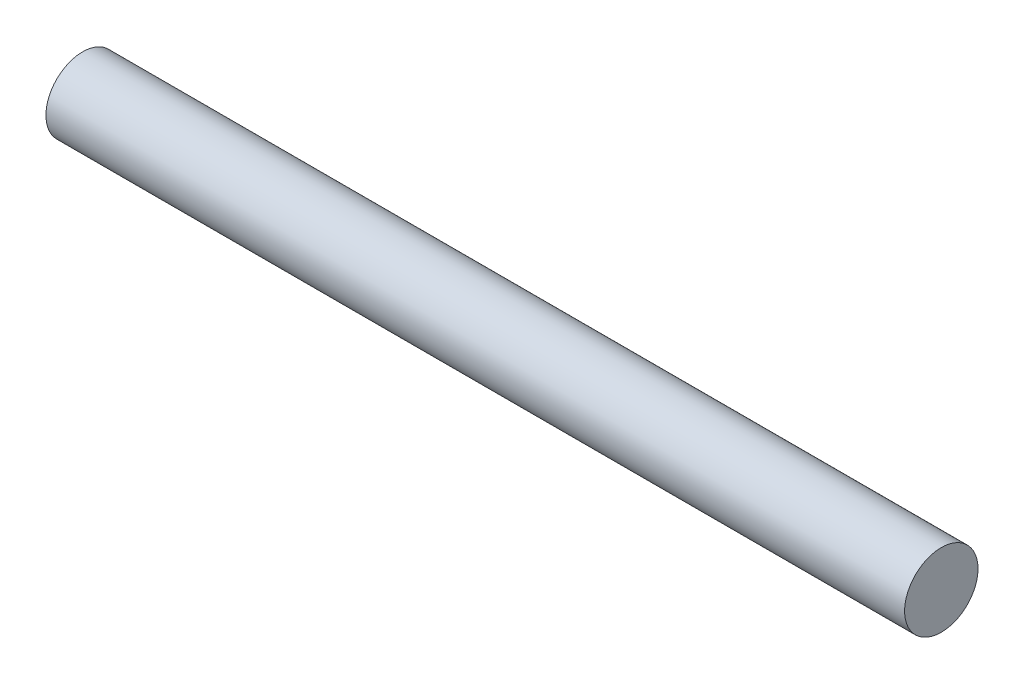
ISO-10303-21;
HEADER;
FILE_DESCRIPTION(('STEP AP214'),'2;1');
FILE_NAME('part.step','',(''),(''),'','','');
FILE_SCHEMA(('AUTOMOTIVE_DESIGN { 1 0 10303 214 1 1 1 1 }'));
ENDSEC;
DATA;
#1=APPLICATION_CONTEXT('core data for automotive mechanical design processes');
#2=APPLICATION_PROTOCOL_DEFINITION('international standard','automotive_design',2000,#1);
#3=PRODUCT_CONTEXT('',#1,'mechanical');
#4=PRODUCT('Part','Part','',(#3));
#5=PRODUCT_RELATED_PRODUCT_CATEGORY('part','',(#4));
#6=PRODUCT_DEFINITION_FORMATION('','',#4);
#7=PRODUCT_DEFINITION_CONTEXT('part definition',#1,'design');
#8=PRODUCT_DEFINITION('design','',#6,#7);
#9=PRODUCT_DEFINITION_SHAPE('','',#8);
#10=(LENGTH_UNIT() NAMED_UNIT(*) SI_UNIT(.MILLI.,.METRE.));
#11=(NAMED_UNIT(*) PLANE_ANGLE_UNIT() SI_UNIT($,.RADIAN.));
#12=(NAMED_UNIT(*) SI_UNIT($,.STERADIAN.) SOLID_ANGLE_UNIT());
#13=UNCERTAINTY_MEASURE_WITH_UNIT(LENGTH_MEASURE(1.E-05),#10,'distance_accuracy_value','');
#14=(GEOMETRIC_REPRESENTATION_CONTEXT(3) GLOBAL_UNCERTAINTY_ASSIGNED_CONTEXT((#13)) GLOBAL_UNIT_ASSIGNED_CONTEXT((#10,
#11,#12)) REPRESENTATION_CONTEXT('',''));
#15=CARTESIAN_POINT('',(0.,0.,0.));
#16=DIRECTION('',(0.,0.,1.));
#17=DIRECTION('',(1.,0.,0.));
#18=AXIS2_PLACEMENT_3D('',#15,#16,#17);
#19=CARTESIAN_POINT('',(0.,0.,0.));
#20=DIRECTION('',(1.,0.,0.));
#21=DIRECTION('',(0.,0.,-1.));
#22=AXIS2_PLACEMENT_3D('',#19,#20,#21);
#23=PLANE('',#22);
#24=CARTESIAN_POINT('',(0.,0.,0.));
#25=DIRECTION('',(1.,0.,0.));
#26=DIRECTION('',(0.,0.,-1.));
#27=AXIS2_PLACEMENT_3D('',#24,#25,#26);
#28=CIRCLE('',#27,2.65);
#29=CARTESIAN_POINT('',(0.,0.,-2.65));
#30=VERTEX_POINT('',#29);
#31=EDGE_CURVE('E18',#30,#30,#28,.T.);
#32=ORIENTED_EDGE('',*,*,#31,.F.);
#33=EDGE_LOOP('',(#32));
#34=FACE_BOUND('',#33,.T.);
#35=ADVANCED_FACE('F14',(#34),#23,.F.);
#36=CARTESIAN_POINT('',(62.,0.,0.));
#37=DIRECTION('',(1.,0.,0.));
#38=DIRECTION('',(0.,0.,-1.));
#39=AXIS2_PLACEMENT_3D('',#36,#37,#38);
#40=PLANE('',#39);
#41=CARTESIAN_POINT('',(62.,0.,0.));
#42=DIRECTION('',(1.,0.,0.));
#43=DIRECTION('',(0.,0.,-1.));
#44=AXIS2_PLACEMENT_3D('',#41,#42,#43);
#45=CIRCLE('',#44,2.65);
#46=CARTESIAN_POINT('',(62.,0.,-2.65));
#47=VERTEX_POINT('',#46);
#48=EDGE_CURVE('E10',#47,#47,#45,.F.);
#49=ORIENTED_EDGE('',*,*,#48,.F.);
#50=EDGE_LOOP('',(#49));
#51=FACE_BOUND('',#50,.T.);
#52=ADVANCED_FACE('F29',(#51),#40,.T.);
#53=CARTESIAN_POINT('',(0.,0.,0.));
#54=DIRECTION('',(1.,0.,0.));
#55=DIRECTION('',(0.,0.,-1.));
#56=AXIS2_PLACEMENT_3D('',#53,#54,#55);
#57=CYLINDRICAL_SURFACE('',#56,2.65);
#58=ORIENTED_EDGE('',*,*,#31,.T.);
#59=EDGE_LOOP('',(#58));
#60=FACE_BOUND('',#59,.T.);
#61=ORIENTED_EDGE('',*,*,#48,.T.);
#62=EDGE_LOOP('',(#61));
#63=FACE_BOUND('',#62,.T.);
#64=ADVANCED_FACE('F16',(#60,#63),#57,.T.);
#65=CLOSED_SHELL('',(#35,#52,#64));
#66=MANIFOLD_SOLID_BREP('B1',#65);
#67=ADVANCED_BREP_SHAPE_REPRESENTATION('',(#18,#66),#14);
#68=SHAPE_DEFINITION_REPRESENTATION(#9,#67);
ENDSEC;
END-ISO-10303-21;
